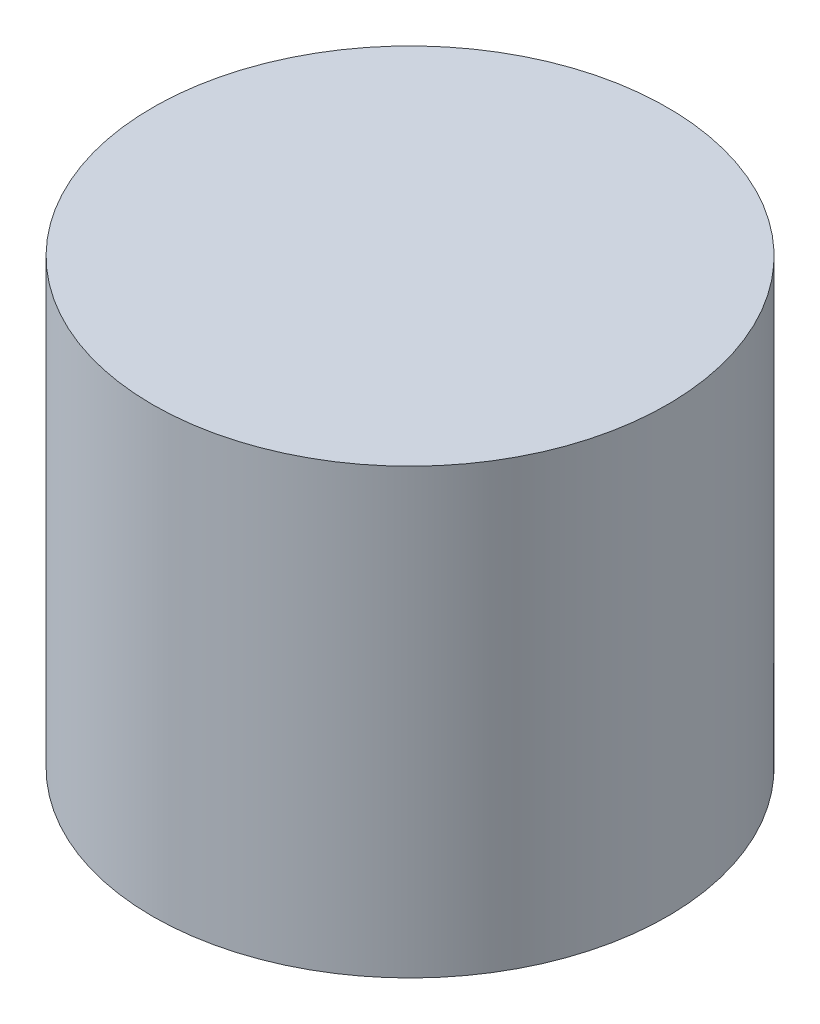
from build123d import *

# Parameters (mm, degrees)
SKETCH1_R           = 16
BOSS_EXTRUDE1_DEPTH = 27.55


with BuildPart() as part:
    # Sketch1 → Boss-Extrude1 (new body)
    with BuildSketch(Plane(origin=(0, 0, 0), x_dir=(1, 0, 0), z_dir=(0, 1, 0))):
        with Locations(Location((0, 0, 0), (0, 0, 270))):
            Circle(SKETCH1_R)
    extrude(amount=BOSS_EXTRUDE1_DEPTH)


solid = part.part
